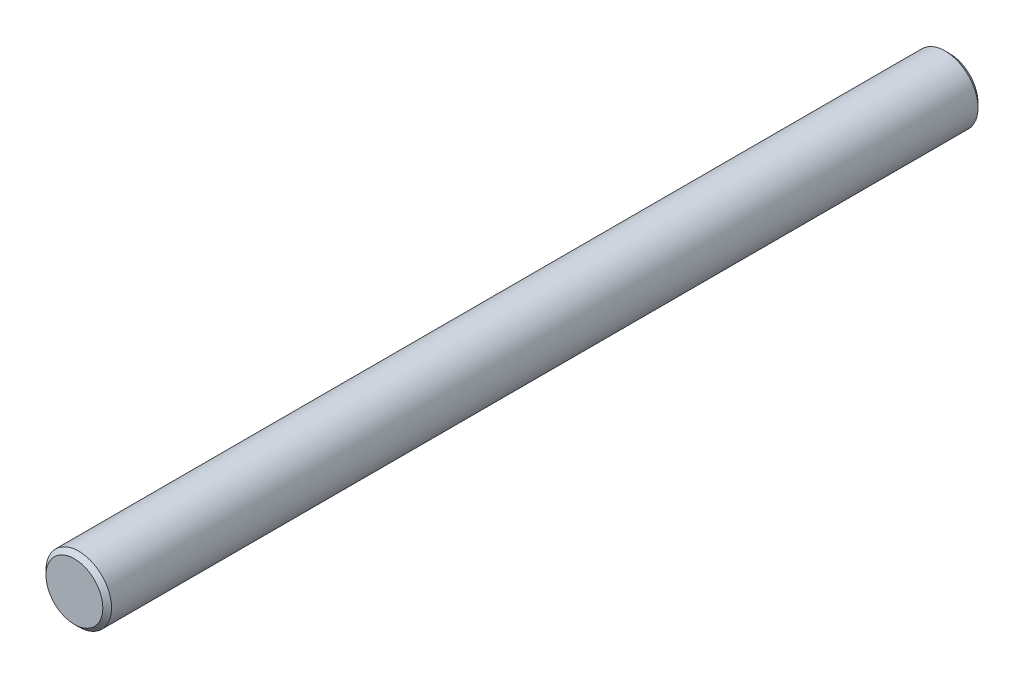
ISO-10303-21;
HEADER;
FILE_DESCRIPTION(('STEP AP214'),'2;1');
FILE_NAME('part.step','',(''),(''),'','','');
FILE_SCHEMA(('AUTOMOTIVE_DESIGN { 1 0 10303 214 1 1 1 1 }'));
ENDSEC;
DATA;
#1=APPLICATION_CONTEXT('core data for automotive mechanical design processes');
#2=APPLICATION_PROTOCOL_DEFINITION('international standard','automotive_design',2000,#1);
#3=PRODUCT_CONTEXT('',#1,'mechanical');
#4=PRODUCT('Part','Part','',(#3));
#5=PRODUCT_RELATED_PRODUCT_CATEGORY('part','',(#4));
#6=PRODUCT_DEFINITION_FORMATION('','',#4);
#7=PRODUCT_DEFINITION_CONTEXT('part definition',#1,'design');
#8=PRODUCT_DEFINITION('design','',#6,#7);
#9=PRODUCT_DEFINITION_SHAPE('','',#8);
#10=(LENGTH_UNIT() NAMED_UNIT(*) SI_UNIT(.MILLI.,.METRE.));
#11=(NAMED_UNIT(*) PLANE_ANGLE_UNIT() SI_UNIT($,.RADIAN.));
#12=(NAMED_UNIT(*) SI_UNIT($,.STERADIAN.) SOLID_ANGLE_UNIT());
#13=UNCERTAINTY_MEASURE_WITH_UNIT(LENGTH_MEASURE(1.E-05),#10,'distance_accuracy_value','');
#14=(GEOMETRIC_REPRESENTATION_CONTEXT(3) GLOBAL_UNCERTAINTY_ASSIGNED_CONTEXT((#13)) GLOBAL_UNIT_ASSIGNED_CONTEXT((#10,
#11,#12)) REPRESENTATION_CONTEXT('',''));
#15=CARTESIAN_POINT('',(0.,0.,0.));
#16=DIRECTION('',(0.,0.,1.));
#17=DIRECTION('',(1.,0.,0.));
#18=AXIS2_PLACEMENT_3D('',#15,#16,#17);
#19=CARTESIAN_POINT('',(0.,0.,40.));
#20=DIRECTION('',(0.,0.,-1.));
#21=DIRECTION('',(-1.,0.,0.));
#22=AXIS2_PLACEMENT_3D('',#19,#20,#21);
#23=CYLINDRICAL_SURFACE('',#22,1.5);
#24=CARTESIAN_POINT('',(0.,0.,0.199999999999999));
#25=DIRECTION('',(0.,0.,1.));
#26=DIRECTION('',(1.,0.,0.));
#27=AXIS2_PLACEMENT_3D('',#24,#25,#26);
#28=CIRCLE('',#27,1.5);
#29=CARTESIAN_POINT('',(1.5,0.,0.199999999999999));
#30=VERTEX_POINT('',#29);
#31=EDGE_CURVE('E34',#30,#30,#28,.T.);
#32=ORIENTED_EDGE('',*,*,#31,.T.);
#33=EDGE_LOOP('',(#32));
#34=FACE_BOUND('',#33,.T.);
#35=CARTESIAN_POINT('',(0.,0.,39.8));
#36=DIRECTION('',(0.,0.,1.));
#37=DIRECTION('',(1.,0.,0.));
#38=AXIS2_PLACEMENT_3D('',#35,#36,#37);
#39=CIRCLE('',#38,1.5);
#40=CARTESIAN_POINT('',(1.5,0.,39.8));
#41=VERTEX_POINT('',#40);
#42=EDGE_CURVE('E38',#41,#41,#39,.F.);
#43=ORIENTED_EDGE('',*,*,#42,.T.);
#44=EDGE_LOOP('',(#43));
#45=FACE_BOUND('',#44,.T.);
#46=ADVANCED_FACE('F24',(#34,#45),#23,.T.);
#47=CARTESIAN_POINT('',(0.,0.,40.));
#48=DIRECTION('',(0.,0.,1.));
#49=DIRECTION('',(1.,0.,0.));
#50=AXIS2_PLACEMENT_3D('',#47,#48,#49);
#51=PLANE('',#50);
#52=CARTESIAN_POINT('',(0.,0.,40.));
#53=DIRECTION('',(0.,0.,1.));
#54=DIRECTION('',(1.,0.,0.));
#55=AXIS2_PLACEMENT_3D('',#52,#53,#54);
#56=CIRCLE('',#55,1.3);
#57=CARTESIAN_POINT('',(1.3,0.,40.));
#58=VERTEX_POINT('',#57);
#59=EDGE_CURVE('E10',#58,#58,#56,.T.);
#60=ORIENTED_EDGE('',*,*,#59,.T.);
#61=EDGE_LOOP('',(#60));
#62=FACE_BOUND('',#61,.T.);
#63=ADVANCED_FACE('F57',(#62),#51,.T.);
#64=CARTESIAN_POINT('',(0.,0.,0.));
#65=DIRECTION('',(0.,0.,1.));
#66=DIRECTION('',(1.,0.,0.));
#67=AXIS2_PLACEMENT_3D('',#64,#65,#66);
#68=PLANE('',#67);
#69=CARTESIAN_POINT('',(0.,0.,0.));
#70=DIRECTION('',(0.,0.,1.));
#71=DIRECTION('',(1.,0.,0.));
#72=AXIS2_PLACEMENT_3D('',#69,#70,#71);
#73=CIRCLE('',#72,1.3);
#74=CARTESIAN_POINT('',(1.3,0.,0.));
#75=VERTEX_POINT('',#74);
#76=EDGE_CURVE('E30',#75,#75,#73,.F.);
#77=ORIENTED_EDGE('',*,*,#76,.T.);
#78=EDGE_LOOP('',(#77));
#79=FACE_BOUND('',#78,.T.);
#80=ADVANCED_FACE('F53',(#79),#68,.F.);
#81=CARTESIAN_POINT('',(0.,0.,0.199999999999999));
#82=DIRECTION('',(0.,0.,1.));
#83=DIRECTION('',(1.,0.,0.));
#84=AXIS2_PLACEMENT_3D('',#81,#82,#83);
#85=CONICAL_SURFACE('',#84,1.5,0.785398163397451);
#86=ORIENTED_EDGE('',*,*,#76,.F.);
#87=EDGE_LOOP('',(#86));
#88=FACE_BOUND('',#87,.T.);
#89=ORIENTED_EDGE('',*,*,#31,.F.);
#90=EDGE_LOOP('',(#89));
#91=FACE_BOUND('',#90,.T.);
#92=ADVANCED_FACE('F48',(#88,#91),#85,.T.);
#93=CARTESIAN_POINT('',(0.,0.,40.));
#94=DIRECTION('',(0.,0.,-1.));
#95=DIRECTION('',(-1.,0.,0.));
#96=AXIS2_PLACEMENT_3D('',#93,#94,#95);
#97=CONICAL_SURFACE('',#96,1.3,0.785398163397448);
#98=ORIENTED_EDGE('',*,*,#42,.F.);
#99=EDGE_LOOP('',(#98));
#100=FACE_BOUND('',#99,.T.);
#101=ORIENTED_EDGE('',*,*,#59,.F.);
#102=EDGE_LOOP('',(#101));
#103=FACE_BOUND('',#102,.T.);
#104=ADVANCED_FACE('F45',(#100,#103),#97,.T.);
#105=CLOSED_SHELL('',(#46,#63,#80,#92,#104));
#106=MANIFOLD_SOLID_BREP('B2',#105);
#107=ADVANCED_BREP_SHAPE_REPRESENTATION('',(#18,#106),#14);
#108=SHAPE_DEFINITION_REPRESENTATION(#9,#107);
ENDSEC;
END-ISO-10303-21;
